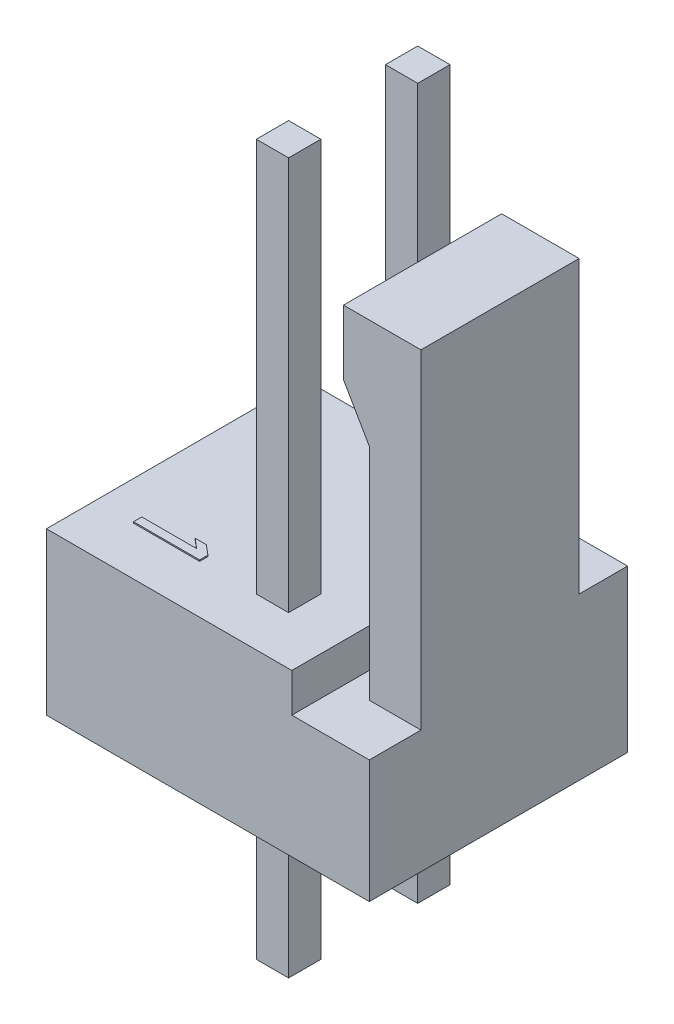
ISO-10303-21;
HEADER;
FILE_DESCRIPTION(('STEP AP214'),'2;1');
FILE_NAME('part.step','',(''),(''),'','','');
FILE_SCHEMA(('AUTOMOTIVE_DESIGN { 1 0 10303 214 1 1 1 1 }'));
ENDSEC;
DATA;
#1=APPLICATION_CONTEXT('core data for automotive mechanical design processes');
#2=APPLICATION_PROTOCOL_DEFINITION('international standard','automotive_design',2000,#1);
#3=PRODUCT_CONTEXT('',#1,'mechanical');
#4=PRODUCT('Part','Part','',(#3));
#5=PRODUCT_RELATED_PRODUCT_CATEGORY('part','',(#4));
#6=PRODUCT_DEFINITION_FORMATION('','',#4);
#7=PRODUCT_DEFINITION_CONTEXT('part definition',#1,'design');
#8=PRODUCT_DEFINITION('design','',#6,#7);
#9=PRODUCT_DEFINITION_SHAPE('','',#8);
#10=(LENGTH_UNIT() NAMED_UNIT(*) SI_UNIT(.MILLI.,.METRE.));
#11=(NAMED_UNIT(*) PLANE_ANGLE_UNIT() SI_UNIT($,.RADIAN.));
#12=(NAMED_UNIT(*) SI_UNIT($,.STERADIAN.) SOLID_ANGLE_UNIT());
#13=UNCERTAINTY_MEASURE_WITH_UNIT(LENGTH_MEASURE(1.E-05),#10,'distance_accuracy_value','');
#14=(GEOMETRIC_REPRESENTATION_CONTEXT(3) GLOBAL_UNCERTAINTY_ASSIGNED_CONTEXT((#13)) GLOBAL_UNIT_ASSIGNED_CONTEXT((#10,
#11,#12)) REPRESENTATION_CONTEXT('',''));
#15=CARTESIAN_POINT('',(0.,0.,0.));
#16=DIRECTION('',(0.,0.,1.));
#17=DIRECTION('',(1.,0.,0.));
#18=AXIS2_PLACEMENT_3D('',#15,#16,#17);
#19=CARTESIAN_POINT('',(5.34504242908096,8.24499214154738,-8.47344));
#20=DIRECTION('',(-0.866025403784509,-0.499999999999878,0.));
#21=DIRECTION('',(-0.499999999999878,0.866025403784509,0.));
#22=AXIS2_PLACEMENT_3D('',#19,#20,#21);
#23=PLANE('',#22);
#24=DIRECTION('',(0.,0.,1.));
#25=VECTOR('',#24,1.);
#26=CARTESIAN_POINT('',(4.826,9.144,-12.7));
#27=LINE('',#26,#25);
#28=CARTESIAN_POINT('',(4.826,9.14400000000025,-11.7475000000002));
#29=VERTEX_POINT('',#28);
#30=CARTESIAN_POINT('',(4.82599999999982,9.14400000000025,-8.636));
#31=VERTEX_POINT('',#30);
#32=EDGE_CURVE('E491',#29,#31,#27,.T.);
#33=ORIENTED_EDGE('',*,*,#32,.F.);
#34=DIRECTION('',(0.499999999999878,-0.866025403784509,0.));
#35=VECTOR('',#34,1.);
#36=CARTESIAN_POINT('',(5.34504242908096,8.24499214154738,-11.7475000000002));
#37=LINE('',#36,#35);
#38=CARTESIAN_POINT('',(5.33400000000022,8.26411818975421,-11.7475000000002));
#39=VERTEX_POINT('',#38);
#40=EDGE_CURVE('E291',#29,#39,#37,.T.);
#41=ORIENTED_EDGE('',*,*,#40,.T.);
#42=DIRECTION('',(0.,0.,-1.));
#43=VECTOR('',#42,1.);
#44=CARTESIAN_POINT('',(5.334,8.26411818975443,-12.7));
#45=LINE('',#44,#43);
#46=CARTESIAN_POINT('',(5.33400000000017,8.26411818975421,-8.636));
#47=VERTEX_POINT('',#46);
#48=EDGE_CURVE('E290',#47,#39,#45,.T.);
#49=ORIENTED_EDGE('',*,*,#48,.F.);
#50=DIRECTION('',(-0.499999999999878,0.866025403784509,0.));
#51=VECTOR('',#50,1.);
#52=CARTESIAN_POINT('',(5.08,8.70405909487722,-8.636));
#53=LINE('',#52,#51);
#54=EDGE_CURVE('E308',#47,#31,#53,.T.);
#55=ORIENTED_EDGE('',*,*,#54,.T.);
#56=EDGE_LOOP('',(#33,#41,#49,#55));
#57=FACE_BOUND('',#56,.T.);
#58=ADVANCED_FACE('F38',(#57),#23,.T.);
#59=CARTESIAN_POINT('',(5.334,3.8504576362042,-8.47344));
#60=DIRECTION('',(-1.,0.,0.));
#61=DIRECTION('',(0.,1.,0.));
#62=AXIS2_PLACEMENT_3D('',#59,#60,#61);
#63=PLANE('',#62);
#64=ORIENTED_EDGE('',*,*,#48,.T.);
#65=DIRECTION('',(0.,-1.,0.));
#66=VECTOR('',#65,1.);
#67=CARTESIAN_POINT('',(5.334,3.8504576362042,-11.7475000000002));
#68=LINE('',#67,#66);
#69=CARTESIAN_POINT('',(5.334,4.699,-11.7475000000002));
#70=VERTEX_POINT('',#69);
#71=EDGE_CURVE('E282',#39,#70,#68,.T.);
#72=ORIENTED_EDGE('',*,*,#71,.T.);
#73=DIRECTION('',(0.,0.,1.));
#74=VECTOR('',#73,1.);
#75=CARTESIAN_POINT('',(5.334,4.699,-8.47344));
#76=LINE('',#75,#74);
#77=CARTESIAN_POINT('',(5.334,4.699,-12.7));
#78=VERTEX_POINT('',#77);
#79=EDGE_CURVE('E270',#78,#70,#76,.T.);
#80=ORIENTED_EDGE('',*,*,#79,.F.);
#81=DIRECTION('',(0.,1.,0.));
#82=VECTOR('',#81,1.);
#83=CARTESIAN_POINT('',(5.334,3.8504576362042,-12.7));
#84=LINE('',#83,#82);
#85=CARTESIAN_POINT('',(5.334,3.937,-12.7));
#86=VERTEX_POINT('',#85);
#87=EDGE_CURVE('E306',#86,#78,#84,.T.);
#88=ORIENTED_EDGE('',*,*,#87,.F.);
#89=DIRECTION('',(0.,0.,-1.));
#90=VECTOR('',#89,1.);
#91=CARTESIAN_POINT('',(5.334,3.937,-12.7));
#92=LINE('',#91,#90);
#93=CARTESIAN_POINT('',(5.334,3.93699999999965,-8.636));
#94=VERTEX_POINT('',#93);
#95=EDGE_CURVE('E454',#94,#86,#92,.T.);
#96=ORIENTED_EDGE('',*,*,#95,.F.);
#97=DIRECTION('',(0.,-1.,0.));
#98=VECTOR('',#97,1.);
#99=CARTESIAN_POINT('',(5.334,7.1755,-8.636));
#100=LINE('',#99,#98);
#101=EDGE_CURVE('E410',#47,#94,#100,.T.);
#102=ORIENTED_EDGE('',*,*,#101,.F.);
#103=EDGE_LOOP('',(#64,#72,#80,#88,#96,#102));
#104=FACE_BOUND('',#103,.T.);
#105=ADVANCED_FACE('F287',(#104),#63,.T.);
#106=CARTESIAN_POINT('',(4.826,9.1186,-8.47344));
#107=DIRECTION('',(-1.,0.,0.));
#108=DIRECTION('',(0.,1.,0.));
#109=AXIS2_PLACEMENT_3D('',#106,#107,#108);
#110=PLANE('',#109);
#111=DIRECTION('',(0.,0.,1.));
#112=VECTOR('',#111,1.);
#113=CARTESIAN_POINT('',(4.826,10.414,-12.7));
#114=LINE('',#113,#112);
#115=CARTESIAN_POINT('',(4.826,10.414,-11.7475000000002));
#116=VERTEX_POINT('',#115);
#117=CARTESIAN_POINT('',(4.826,10.414,-8.636));
#118=VERTEX_POINT('',#117);
#119=EDGE_CURVE('E399',#116,#118,#114,.T.);
#120=ORIENTED_EDGE('',*,*,#119,.F.);
#121=DIRECTION('',(0.,-1.,0.));
#122=VECTOR('',#121,1.);
#123=CARTESIAN_POINT('',(4.826,9.1186,-11.7475000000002));
#124=LINE('',#123,#122);
#125=EDGE_CURVE('E295',#116,#29,#124,.T.);
#126=ORIENTED_EDGE('',*,*,#125,.T.);
#127=ORIENTED_EDGE('',*,*,#32,.T.);
#128=DIRECTION('',(0.,-1.,0.));
#129=VECTOR('',#128,1.);
#130=CARTESIAN_POINT('',(4.826,7.1755,-8.636));
#131=LINE('',#130,#129);
#132=EDGE_CURVE('E404',#118,#31,#131,.T.);
#133=ORIENTED_EDGE('',*,*,#132,.F.);
#134=EDGE_LOOP('',(#120,#126,#127,#133));
#135=FACE_BOUND('',#134,.T.);
#136=ADVANCED_FACE('F560',(#135),#110,.T.);
#137=CARTESIAN_POINT('',(4.79552,10.414,-8.47344));
#138=DIRECTION('',(0.,1.,0.));
#139=DIRECTION('',(1.,0.,0.));
#140=AXIS2_PLACEMENT_3D('',#137,#138,#139);
#141=PLANE('',#140);
#142=DIRECTION('',(0.,0.,1.));
#143=VECTOR('',#142,1.);
#144=CARTESIAN_POINT('',(6.35,10.414,-12.7));
#145=LINE('',#144,#143);
#146=CARTESIAN_POINT('',(6.35,10.414,-11.7475000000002));
#147=VERTEX_POINT('',#146);
#148=CARTESIAN_POINT('',(6.35,10.414,-8.636));
#149=VERTEX_POINT('',#148);
#150=EDGE_CURVE('E347',#147,#149,#145,.T.);
#151=ORIENTED_EDGE('',*,*,#150,.F.);
#152=DIRECTION('',(-1.,0.,0.));
#153=VECTOR('',#152,1.);
#154=CARTESIAN_POINT('',(4.79552,10.414,-11.7475000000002));
#155=LINE('',#154,#153);
#156=EDGE_CURVE('E564',#147,#116,#155,.T.);
#157=ORIENTED_EDGE('',*,*,#156,.T.);
#158=ORIENTED_EDGE('',*,*,#119,.T.);
#159=DIRECTION('',(1.,0.,0.));
#160=VECTOR('',#159,1.);
#161=CARTESIAN_POINT('',(5.588,10.414,-8.636));
#162=LINE('',#161,#160);
#163=EDGE_CURVE('E401',#118,#149,#162,.T.);
#164=ORIENTED_EDGE('',*,*,#163,.T.);
#165=EDGE_LOOP('',(#151,#157,#158,#164));
#166=FACE_BOUND('',#165,.T.);
#167=ADVANCED_FACE('F556',(#166),#141,.T.);
#168=CARTESIAN_POINT('',(6.35,10.5918,-7.4168));
#169=DIRECTION('',(1.,0.,0.));
#170=DIRECTION('',(0.,-1.,0.));
#171=AXIS2_PLACEMENT_3D('',#168,#169,#170);
#172=PLANE('',#171);
#173=DIRECTION('',(0.,0.,-1.));
#174=VECTOR('',#173,1.);
#175=CARTESIAN_POINT('',(6.35,4.699,-7.4168));
#176=LINE('',#175,#174);
#177=CARTESIAN_POINT('',(6.35,4.699,-11.7475000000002));
#178=VERTEX_POINT('',#177);
#179=CARTESIAN_POINT('',(6.35,4.699,-12.7));
#180=VERTEX_POINT('',#179);
#181=EDGE_CURVE('E53',#178,#180,#176,.T.);
#182=ORIENTED_EDGE('',*,*,#181,.F.);
#183=DIRECTION('',(0.,1.,0.));
#184=VECTOR('',#183,1.);
#185=CARTESIAN_POINT('',(6.35,10.5918,-11.7475000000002));
#186=LINE('',#185,#184);
#187=EDGE_CURVE('E278',#178,#147,#186,.T.);
#188=ORIENTED_EDGE('',*,*,#187,.T.);
#189=ORIENTED_EDGE('',*,*,#150,.T.);
#190=DIRECTION('',(0.,-1.,0.));
#191=VECTOR('',#190,1.);
#192=CARTESIAN_POINT('',(6.35,5.969,-8.636));
#193=LINE('',#192,#191);
#194=CARTESIAN_POINT('',(6.35,3.937,-8.636));
#195=VERTEX_POINT('',#194);
#196=EDGE_CURVE('E349',#149,#195,#193,.T.);
#197=ORIENTED_EDGE('',*,*,#196,.T.);
#198=DIRECTION('',(0.,0.,-1.));
#199=VECTOR('',#198,1.);
#200=CARTESIAN_POINT('',(6.35,3.937,-12.7));
#201=LINE('',#200,#199);
#202=CARTESIAN_POINT('',(6.35,3.937,-7.62));
#203=VERTEX_POINT('',#202);
#204=EDGE_CURVE('E450',#203,#195,#201,.T.);
#205=ORIENTED_EDGE('',*,*,#204,.F.);
#206=DIRECTION('',(0.,-1.,0.));
#207=VECTOR('',#206,1.);
#208=CARTESIAN_POINT('',(6.35,3.1115,-7.62));
#209=LINE('',#208,#207);
#210=CARTESIAN_POINT('',(6.35,1.524,-7.62));
#211=VERTEX_POINT('',#210);
#212=EDGE_CURVE('E318',#203,#211,#209,.T.);
#213=ORIENTED_EDGE('',*,*,#212,.T.);
#214=DIRECTION('',(0.,0.,1.));
#215=VECTOR('',#214,1.);
#216=CARTESIAN_POINT('',(6.35,1.524,-12.7));
#217=LINE('',#216,#215);
#218=CARTESIAN_POINT('',(6.35,1.524,-12.7));
#219=VERTEX_POINT('',#218);
#220=EDGE_CURVE('E345',#219,#211,#217,.T.);
#221=ORIENTED_EDGE('',*,*,#220,.F.);
#222=DIRECTION('',(0.,-1.,0.));
#223=VECTOR('',#222,1.);
#224=CARTESIAN_POINT('',(6.35,10.5918,-12.7));
#225=LINE('',#224,#223);
#226=EDGE_CURVE('E300',#180,#219,#225,.T.);
#227=ORIENTED_EDGE('',*,*,#226,.F.);
#228=EDGE_LOOP('',(#182,#188,#189,#197,#205,#213,#221,#227));
#229=FACE_BOUND('',#228,.T.);
#230=ADVANCED_FACE('F552',(#229),#172,.T.);
#231=CARTESIAN_POINT('',(3.175,12.7254,-11.0904151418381));
#232=DIRECTION('',(-1.,0.,0.));
#233=DIRECTION('',(0.,0.,-1.));
#234=AXIS2_PLACEMENT_3D('',#231,#232,#233);
#235=PLANE('',#234);
#236=DIRECTION('',(0.,0.,-1.));
#237=VECTOR('',#236,1.);
#238=CARTESIAN_POINT('',(3.17500000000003,-1.524,-11.43));
#239=LINE('',#238,#237);
#240=CARTESIAN_POINT('',(3.17499999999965,-1.524,-11.1124999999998));
#241=VERTEX_POINT('',#240);
#242=CARTESIAN_POINT('',(3.17499999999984,-1.524,-11.7475000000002));
#243=VERTEX_POINT('',#242);
#244=EDGE_CURVE('E482',#241,#243,#239,.T.);
#245=ORIENTED_EDGE('',*,*,#244,.F.);
#246=DIRECTION('',(0.,-1.,0.));
#247=VECTOR('',#246,1.);
#248=CARTESIAN_POINT('',(3.17499999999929,5.461,-11.1125));
#249=LINE('',#248,#247);
#250=CARTESIAN_POINT('',(3.17499999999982,1.524,-11.1124999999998));
#251=VERTEX_POINT('',#250);
#252=EDGE_CURVE('E487',#251,#241,#249,.T.);
#253=ORIENTED_EDGE('',*,*,#252,.F.);
#254=DIRECTION('',(0.,0.,-1.));
#255=VECTOR('',#254,1.);
#256=CARTESIAN_POINT('',(3.175,1.524,-11.43));
#257=LINE('',#256,#255);
#258=CARTESIAN_POINT('',(3.17499999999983,1.524,-11.7475000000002));
#259=VERTEX_POINT('',#258);
#260=EDGE_CURVE('E500',#251,#259,#257,.T.);
#261=ORIENTED_EDGE('',*,*,#260,.T.);
#262=DIRECTION('',(0.,1.,0.));
#263=VECTOR('',#262,1.);
#264=CARTESIAN_POINT('',(3.17499999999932,5.461,-11.7475));
#265=LINE('',#264,#263);
#266=EDGE_CURVE('E474',#243,#259,#265,.T.);
#267=ORIENTED_EDGE('',*,*,#266,.F.);
#268=EDGE_LOOP('',(#245,#253,#261,#267));
#269=FACE_BOUND('',#268,.T.);
#270=ADVANCED_FACE('F576',(#269),#235,.T.);
#271=CARTESIAN_POINT('',(3.175,12.7254,-8.55041514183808));
#272=DIRECTION('',(-1.,0.,0.));
#273=DIRECTION('',(0.,0.,-1.));
#274=AXIS2_PLACEMENT_3D('',#271,#272,#273);
#275=PLANE('',#274);
#276=DIRECTION('',(0.,0.,-1.));
#277=VECTOR('',#276,1.);
#278=CARTESIAN_POINT('',(3.17500000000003,-1.524,-8.89));
#279=LINE('',#278,#277);
#280=CARTESIAN_POINT('',(3.17499999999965,-1.524,-8.57249999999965));
#281=VERTEX_POINT('',#280);
#282=CARTESIAN_POINT('',(3.17499999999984,-1.524,-9.20750000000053));
#283=VERTEX_POINT('',#282);
#284=EDGE_CURVE('E465',#281,#283,#279,.T.);
#285=ORIENTED_EDGE('',*,*,#284,.F.);
#286=DIRECTION('',(0.,-1.,0.));
#287=VECTOR('',#286,1.);
#288=CARTESIAN_POINT('',(3.17499999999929,5.461,-8.5725));
#289=LINE('',#288,#287);
#290=CARTESIAN_POINT('',(3.17499999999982,1.524,-8.57249999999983));
#291=VERTEX_POINT('',#290);
#292=EDGE_CURVE('E470',#291,#281,#289,.T.);
#293=ORIENTED_EDGE('',*,*,#292,.F.);
#294=DIRECTION('',(0.,0.,-1.));
#295=VECTOR('',#294,1.);
#296=CARTESIAN_POINT('',(3.175,1.524,-8.89));
#297=LINE('',#296,#295);
#298=CARTESIAN_POINT('',(3.17499999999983,1.524,-9.20750000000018));
#299=VERTEX_POINT('',#298);
#300=EDGE_CURVE('E498',#291,#299,#297,.T.);
#301=ORIENTED_EDGE('',*,*,#300,.T.);
#302=DIRECTION('',(0.,1.,0.));
#303=VECTOR('',#302,1.);
#304=CARTESIAN_POINT('',(3.17499999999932,5.461,-9.2075));
#305=LINE('',#304,#303);
#306=EDGE_CURVE('E457',#283,#299,#305,.T.);
#307=ORIENTED_EDGE('',*,*,#306,.F.);
#308=EDGE_LOOP('',(#285,#293,#301,#307));
#309=FACE_BOUND('',#308,.T.);
#310=ADVANCED_FACE('F579',(#309),#275,.T.);
#311=CARTESIAN_POINT('',(3.81,12.7254,-11.7695848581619));
#312=DIRECTION('',(1.,0.,0.));
#313=DIRECTION('',(0.,0.,1.));
#314=AXIS2_PLACEMENT_3D('',#311,#312,#313);
#315=PLANE('',#314);
#316=DIRECTION('',(0.,0.,1.));
#317=VECTOR('',#316,1.);
#318=CARTESIAN_POINT('',(3.81000000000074,12.446,-11.43));
#319=LINE('',#318,#317);
#320=CARTESIAN_POINT('',(3.81000000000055,12.446,-11.7475000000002));
#321=VERTEX_POINT('',#320);
#322=CARTESIAN_POINT('',(3.81000000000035,12.446,-11.1124999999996));
#323=VERTEX_POINT('',#322);
#324=EDGE_CURVE('E443',#321,#323,#319,.T.);
#325=ORIENTED_EDGE('',*,*,#324,.T.);
#326=DIRECTION('',(0.,1.,0.));
#327=VECTOR('',#326,1.);
#328=CARTESIAN_POINT('',(3.81000000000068,5.461,-11.1125));
#329=LINE('',#328,#327);
#330=CARTESIAN_POINT('',(3.81000000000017,4.699,-11.1124999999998));
#331=VERTEX_POINT('',#330);
#332=EDGE_CURVE('E446',#331,#323,#329,.T.);
#333=ORIENTED_EDGE('',*,*,#332,.F.);
#334=DIRECTION('',(0.,0.,-1.));
#335=VECTOR('',#334,1.);
#336=CARTESIAN_POINT('',(3.81,4.699,-11.43));
#337=LINE('',#336,#335);
#338=CARTESIAN_POINT('',(3.81000000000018,4.699,-11.7475000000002));
#339=VERTEX_POINT('',#338);
#340=EDGE_CURVE('E496',#331,#339,#337,.T.);
#341=ORIENTED_EDGE('',*,*,#340,.T.);
#342=DIRECTION('',(0.,-1.,0.));
#343=VECTOR('',#342,1.);
#344=CARTESIAN_POINT('',(3.81000000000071,5.461,-11.7475));
#345=LINE('',#344,#343);
#346=EDGE_CURVE('E432',#321,#339,#345,.T.);
#347=ORIENTED_EDGE('',*,*,#346,.F.);
#348=EDGE_LOOP('',(#325,#333,#341,#347));
#349=FACE_BOUND('',#348,.T.);
#350=ADVANCED_FACE('F583',(#349),#315,.T.);
#351=CARTESIAN_POINT('',(3.81,12.7254,-9.22958485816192));
#352=DIRECTION('',(1.,0.,0.));
#353=DIRECTION('',(0.,0.,1.));
#354=AXIS2_PLACEMENT_3D('',#351,#352,#353);
#355=PLANE('',#354);
#356=DIRECTION('',(0.,0.,1.));
#357=VECTOR('',#356,1.);
#358=CARTESIAN_POINT('',(3.81000000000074,12.446,-8.89));
#359=LINE('',#358,#357);
#360=CARTESIAN_POINT('',(3.81000000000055,12.446,-9.20750000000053));
#361=VERTEX_POINT('',#360);
#362=CARTESIAN_POINT('',(3.81000000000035,12.446,-8.57249999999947));
#363=VERTEX_POINT('',#362);
#364=EDGE_CURVE('E425',#361,#363,#359,.T.);
#365=ORIENTED_EDGE('',*,*,#364,.T.);
#366=DIRECTION('',(0.,1.,0.));
#367=VECTOR('',#366,1.);
#368=CARTESIAN_POINT('',(3.81000000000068,5.461,-8.5725));
#369=LINE('',#368,#367);
#370=CARTESIAN_POINT('',(3.81000000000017,4.699,-8.57249999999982));
#371=VERTEX_POINT('',#370);
#372=EDGE_CURVE('E428',#371,#363,#369,.T.);
#373=ORIENTED_EDGE('',*,*,#372,.F.);
#374=DIRECTION('',(0.,0.,-1.));
#375=VECTOR('',#374,1.);
#376=CARTESIAN_POINT('',(3.81,4.699,-8.89));
#377=LINE('',#376,#375);
#378=CARTESIAN_POINT('',(3.81000000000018,4.699,-9.20750000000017));
#379=VERTEX_POINT('',#378);
#380=EDGE_CURVE('E494',#371,#379,#377,.T.);
#381=ORIENTED_EDGE('',*,*,#380,.T.);
#382=DIRECTION('',(0.,-1.,0.));
#383=VECTOR('',#382,1.);
#384=CARTESIAN_POINT('',(3.81000000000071,5.461,-9.2075));
#385=LINE('',#384,#383);
#386=EDGE_CURVE('E413',#361,#379,#385,.T.);
#387=ORIENTED_EDGE('',*,*,#386,.F.);
#388=EDGE_LOOP('',(#365,#373,#381,#387));
#389=FACE_BOUND('',#388,.T.);
#390=ADVANCED_FACE('F587',(#389),#355,.T.);
#391=CARTESIAN_POINT('',(3.83208485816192,12.7254,-11.1125));
#392=DIRECTION('',(0.,0.,1.));
#393=DIRECTION('',(-1.,0.,0.));
#394=AXIS2_PLACEMENT_3D('',#391,#392,#393);
#395=PLANE('',#394);
#396=DIRECTION('',(-1.,0.,0.));
#397=VECTOR('',#396,1.);
#398=CARTESIAN_POINT('',(3.4925,-1.524,-11.1125));
#399=LINE('',#398,#397);
#400=CARTESIAN_POINT('',(3.81000000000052,-1.524,-11.1124999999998));
#401=VERTEX_POINT('',#400);
#402=EDGE_CURVE('E484',#401,#241,#399,.T.);
#403=ORIENTED_EDGE('',*,*,#402,.F.);
#404=DIRECTION('',(0.,-1.,0.));
#405=VECTOR('',#404,1.);
#406=CARTESIAN_POINT('',(3.81,5.461,-11.1124999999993));
#407=LINE('',#406,#405);
#408=CARTESIAN_POINT('',(3.81000000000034,1.524,-11.1124999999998));
#409=VERTEX_POINT('',#408);
#410=EDGE_CURVE('E397',#409,#401,#407,.T.);
#411=ORIENTED_EDGE('',*,*,#410,.F.);
#412=DIRECTION('',(-1.,0.,0.));
#413=VECTOR('',#412,1.);
#414=CARTESIAN_POINT('',(3.4925,1.524,-11.1125));
#415=LINE('',#414,#413);
#416=EDGE_CURVE('E489',#409,#251,#415,.T.);
#417=ORIENTED_EDGE('',*,*,#416,.T.);
#418=ORIENTED_EDGE('',*,*,#252,.T.);
#419=EDGE_LOOP('',(#403,#411,#417,#418));
#420=FACE_BOUND('',#419,.T.);
#421=ADVANCED_FACE('F590',(#420),#395,.T.);
#422=CARTESIAN_POINT('',(3.83208485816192,-1.524,-11.7695848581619));
#423=DIRECTION('',(0.,-1.,0.));
#424=DIRECTION('',(0.,0.,1.));
#425=AXIS2_PLACEMENT_3D('',#422,#423,#424);
#426=PLANE('',#425);
#427=ORIENTED_EDGE('',*,*,#402,.T.);
#428=ORIENTED_EDGE('',*,*,#244,.T.);
#429=DIRECTION('',(-1.,0.,0.));
#430=VECTOR('',#429,1.);
#431=CARTESIAN_POINT('',(3.4925,-1.524,-11.7475));
#432=LINE('',#431,#430);
#433=CARTESIAN_POINT('',(3.81000000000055,-1.524,-11.7475000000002));
#434=VERTEX_POINT('',#433);
#435=EDGE_CURVE('E477',#434,#243,#432,.T.);
#436=ORIENTED_EDGE('',*,*,#435,.F.);
#437=DIRECTION('',(0.,0.,-1.));
#438=VECTOR('',#437,1.);
#439=CARTESIAN_POINT('',(3.81,-1.524,-11.43));
#440=LINE('',#439,#438);
#441=EDGE_CURVE('E395',#401,#434,#440,.T.);
#442=ORIENTED_EDGE('',*,*,#441,.F.);
#443=EDGE_LOOP('',(#427,#428,#436,#442));
#444=FACE_BOUND('',#443,.T.);
#445=ADVANCED_FACE('F597',(#444),#426,.T.);
#446=CARTESIAN_POINT('',(3.15291514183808,12.7254,-11.7475));
#447=DIRECTION('',(0.,0.,-1.));
#448=DIRECTION('',(1.,0.,0.));
#449=AXIS2_PLACEMENT_3D('',#446,#447,#448);
#450=PLANE('',#449);
#451=ORIENTED_EDGE('',*,*,#435,.T.);
#452=ORIENTED_EDGE('',*,*,#266,.T.);
#453=DIRECTION('',(1.,0.,0.));
#454=VECTOR('',#453,1.);
#455=CARTESIAN_POINT('',(3.4925,1.524,-11.7475));
#456=LINE('',#455,#454);
#457=CARTESIAN_POINT('',(3.81000000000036,1.524,-11.7475000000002));
#458=VERTEX_POINT('',#457);
#459=EDGE_CURVE('E480',#259,#458,#456,.T.);
#460=ORIENTED_EDGE('',*,*,#459,.T.);
#461=DIRECTION('',(0.,1.,0.));
#462=VECTOR('',#461,1.);
#463=CARTESIAN_POINT('',(3.81,5.461,-11.7475000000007));
#464=LINE('',#463,#462);
#465=EDGE_CURVE('E392',#434,#458,#464,.T.);
#466=ORIENTED_EDGE('',*,*,#465,.F.);
#467=EDGE_LOOP('',(#451,#452,#460,#466));
#468=FACE_BOUND('',#467,.T.);
#469=ADVANCED_FACE('F601',(#468),#450,.T.);
#470=CARTESIAN_POINT('',(3.83208485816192,12.7254,-8.5725));
#471=DIRECTION('',(0.,0.,1.));
#472=DIRECTION('',(-1.,0.,0.));
#473=AXIS2_PLACEMENT_3D('',#470,#471,#472);
#474=PLANE('',#473);
#475=DIRECTION('',(-1.,0.,0.));
#476=VECTOR('',#475,1.);
#477=CARTESIAN_POINT('',(3.4925,-1.524,-8.57249999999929));
#478=LINE('',#477,#476);
#479=CARTESIAN_POINT('',(3.81000000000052,-1.524,-8.57249999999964));
#480=VERTEX_POINT('',#479);
#481=EDGE_CURVE('E467',#480,#281,#478,.T.);
#482=ORIENTED_EDGE('',*,*,#481,.F.);
#483=DIRECTION('',(0.,-1.,0.));
#484=VECTOR('',#483,1.);
#485=CARTESIAN_POINT('',(3.81,5.461,-8.57249999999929));
#486=LINE('',#485,#484);
#487=CARTESIAN_POINT('',(3.81000000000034,1.524,-8.57249999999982));
#488=VERTEX_POINT('',#487);
#489=EDGE_CURVE('E390',#488,#480,#486,.T.);
#490=ORIENTED_EDGE('',*,*,#489,.F.);
#491=DIRECTION('',(-1.,0.,0.));
#492=VECTOR('',#491,1.);
#493=CARTESIAN_POINT('',(3.4925,1.524,-8.5725));
#494=LINE('',#493,#492);
#495=EDGE_CURVE('E472',#488,#291,#494,.T.);
#496=ORIENTED_EDGE('',*,*,#495,.T.);
#497=ORIENTED_EDGE('',*,*,#292,.T.);
#498=EDGE_LOOP('',(#482,#490,#496,#497));
#499=FACE_BOUND('',#498,.T.);
#500=ADVANCED_FACE('F605',(#499),#474,.T.);
#501=CARTESIAN_POINT('',(3.83208485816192,-1.524,-9.22958485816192));
#502=DIRECTION('',(0.,-1.,0.));
#503=DIRECTION('',(0.,0.,1.));
#504=AXIS2_PLACEMENT_3D('',#501,#502,#503);
#505=PLANE('',#504);
#506=ORIENTED_EDGE('',*,*,#481,.T.);
#507=ORIENTED_EDGE('',*,*,#284,.T.);
#508=DIRECTION('',(-1.,0.,0.));
#509=VECTOR('',#508,1.);
#510=CARTESIAN_POINT('',(3.4925,-1.524,-9.2075));
#511=LINE('',#510,#509);
#512=CARTESIAN_POINT('',(3.81000000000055,-1.524,-9.20750000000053));
#513=VERTEX_POINT('',#512);
#514=EDGE_CURVE('E460',#513,#283,#511,.T.);
#515=ORIENTED_EDGE('',*,*,#514,.F.);
#516=DIRECTION('',(0.,0.,-1.));
#517=VECTOR('',#516,1.);
#518=CARTESIAN_POINT('',(3.81,-1.524,-8.89));
#519=LINE('',#518,#517);
#520=EDGE_CURVE('E388',#480,#513,#519,.T.);
#521=ORIENTED_EDGE('',*,*,#520,.F.);
#522=EDGE_LOOP('',(#506,#507,#515,#521));
#523=FACE_BOUND('',#522,.T.);
#524=ADVANCED_FACE('F609',(#523),#505,.T.);
#525=CARTESIAN_POINT('',(3.15291514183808,12.7254,-9.2075));
#526=DIRECTION('',(0.,0.,-1.));
#527=DIRECTION('',(1.,0.,0.));
#528=AXIS2_PLACEMENT_3D('',#525,#526,#527);
#529=PLANE('',#528);
#530=ORIENTED_EDGE('',*,*,#514,.T.);
#531=ORIENTED_EDGE('',*,*,#306,.T.);
#532=DIRECTION('',(1.,0.,0.));
#533=VECTOR('',#532,1.);
#534=CARTESIAN_POINT('',(3.4925,1.524,-9.2075));
#535=LINE('',#534,#533);
#536=CARTESIAN_POINT('',(3.81000000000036,1.524,-9.20750000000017));
#537=VERTEX_POINT('',#536);
#538=EDGE_CURVE('E463',#299,#537,#535,.T.);
#539=ORIENTED_EDGE('',*,*,#538,.T.);
#540=DIRECTION('',(0.,1.,0.));
#541=VECTOR('',#540,1.);
#542=CARTESIAN_POINT('',(3.81,5.461,-9.20750000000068));
#543=LINE('',#542,#541);
#544=EDGE_CURVE('E385',#513,#537,#543,.T.);
#545=ORIENTED_EDGE('',*,*,#544,.F.);
#546=EDGE_LOOP('',(#530,#531,#539,#545));
#547=FACE_BOUND('',#546,.T.);
#548=ADVANCED_FACE('F613',(#547),#529,.T.);
#549=CARTESIAN_POINT('',(4.79552,3.937,-7.4168));
#550=DIRECTION('',(0.,1.,0.));
#551=DIRECTION('',(1.,0.,0.));
#552=AXIS2_PLACEMENT_3D('',#549,#550,#551);
#553=PLANE('',#552);
#554=DIRECTION('',(1.,0.,0.));
#555=VECTOR('',#554,1.);
#556=CARTESIAN_POINT('',(4.79552,3.937,-12.7));
#557=LINE('',#556,#555);
#558=CARTESIAN_POINT('',(4.826,3.93699999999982,-12.7));
#559=VERTEX_POINT('',#558);
#560=EDGE_CURVE('E304',#559,#86,#557,.T.);
#561=ORIENTED_EDGE('',*,*,#560,.F.);
#562=DIRECTION('',(0.,0.,-1.));
#563=VECTOR('',#562,1.);
#564=CARTESIAN_POINT('',(4.826,3.93699999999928,-12.7));
#565=LINE('',#564,#563);
#566=CARTESIAN_POINT('',(4.826,3.93699999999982,-7.62));
#567=VERTEX_POINT('',#566);
#568=EDGE_CURVE('E380',#567,#559,#565,.T.);
#569=ORIENTED_EDGE('',*,*,#568,.F.);
#570=DIRECTION('',(1.,0.,0.));
#571=VECTOR('',#570,1.);
#572=CARTESIAN_POINT('',(5.588,3.937,-7.62));
#573=LINE('',#572,#571);
#574=EDGE_CURVE('E452',#567,#203,#573,.T.);
#575=ORIENTED_EDGE('',*,*,#574,.T.);
#576=ORIENTED_EDGE('',*,*,#204,.T.);
#577=DIRECTION('',(1.,0.,0.));
#578=VECTOR('',#577,1.);
#579=CARTESIAN_POINT('',(5.588,3.937,-8.636));
#580=LINE('',#579,#578);
#581=EDGE_CURVE('E407',#94,#195,#580,.T.);
#582=ORIENTED_EDGE('',*,*,#581,.F.);
#583=ORIENTED_EDGE('',*,*,#95,.T.);
#584=EDGE_LOOP('',(#561,#569,#575,#576,#582,#583));
#585=FACE_BOUND('',#584,.T.);
#586=ADVANCED_FACE('F542',(#585),#553,.T.);
#587=CARTESIAN_POINT('',(3.83208485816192,12.7254,-11.1125));
#588=DIRECTION('',(0.,0.,1.));
#589=DIRECTION('',(-1.,0.,0.));
#590=AXIS2_PLACEMENT_3D('',#587,#588,#589);
#591=PLANE('',#590);
#592=DIRECTION('',(-1.,0.,0.));
#593=VECTOR('',#592,1.);
#594=CARTESIAN_POINT('',(3.4925,12.446,-11.1125));
#595=LINE('',#594,#593);
#596=CARTESIAN_POINT('',(3.17499999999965,12.446,-11.1124999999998));
#597=VERTEX_POINT('',#596);
#598=EDGE_CURVE('E440',#323,#597,#595,.T.);
#599=ORIENTED_EDGE('',*,*,#598,.T.);
#600=DIRECTION('',(0.,1.,0.));
#601=VECTOR('',#600,1.);
#602=CARTESIAN_POINT('',(3.175,5.461,-11.1124999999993));
#603=LINE('',#602,#601);
#604=CARTESIAN_POINT('',(3.17499999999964,4.699,-11.1124999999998));
#605=VERTEX_POINT('',#604);
#606=EDGE_CURVE('E378',#605,#597,#603,.T.);
#607=ORIENTED_EDGE('',*,*,#606,.F.);
#608=DIRECTION('',(1.,0.,0.));
#609=VECTOR('',#608,1.);
#610=CARTESIAN_POINT('',(3.4925,4.699,-11.1125));
#611=LINE('',#610,#609);
#612=EDGE_CURVE('E448',#605,#331,#611,.T.);
#613=ORIENTED_EDGE('',*,*,#612,.T.);
#614=ORIENTED_EDGE('',*,*,#332,.T.);
#615=EDGE_LOOP('',(#599,#607,#613,#614));
#616=FACE_BOUND('',#615,.T.);
#617=ADVANCED_FACE('F620',(#616),#591,.T.);
#618=CARTESIAN_POINT('',(3.83208485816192,12.446,-11.7695848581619));
#619=DIRECTION('',(0.,-1.,0.));
#620=DIRECTION('',(0.,0.,1.));
#621=AXIS2_PLACEMENT_3D('',#618,#619,#620);
#622=PLANE('',#621);
#623=ORIENTED_EDGE('',*,*,#598,.F.);
#624=ORIENTED_EDGE('',*,*,#324,.F.);
#625=DIRECTION('',(1.,0.,0.));
#626=VECTOR('',#625,1.);
#627=CARTESIAN_POINT('',(3.4925,12.446,-11.7475));
#628=LINE('',#627,#626);
#629=CARTESIAN_POINT('',(3.17499999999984,12.446,-11.7475000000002));
#630=VERTEX_POINT('',#629);
#631=EDGE_CURVE('E435',#630,#321,#628,.T.);
#632=ORIENTED_EDGE('',*,*,#631,.F.);
#633=DIRECTION('',(0.,0.,-1.));
#634=VECTOR('',#633,1.);
#635=CARTESIAN_POINT('',(3.175,12.446,-11.43));
#636=LINE('',#635,#634);
#637=EDGE_CURVE('E376',#597,#630,#636,.T.);
#638=ORIENTED_EDGE('',*,*,#637,.F.);
#639=EDGE_LOOP('',(#623,#624,#632,#638));
#640=FACE_BOUND('',#639,.T.);
#641=ADVANCED_FACE('F623',(#640),#622,.F.);
#642=CARTESIAN_POINT('',(3.15291514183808,12.7254,-11.7475));
#643=DIRECTION('',(0.,0.,-1.));
#644=DIRECTION('',(1.,0.,0.));
#645=AXIS2_PLACEMENT_3D('',#642,#643,#644);
#646=PLANE('',#645);
#647=ORIENTED_EDGE('',*,*,#631,.T.);
#648=ORIENTED_EDGE('',*,*,#346,.T.);
#649=DIRECTION('',(-1.,0.,0.));
#650=VECTOR('',#649,1.);
#651=CARTESIAN_POINT('',(3.4925,4.699,-11.7475));
#652=LINE('',#651,#650);
#653=CARTESIAN_POINT('',(3.17499999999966,4.699,-11.7475000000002));
#654=VERTEX_POINT('',#653);
#655=EDGE_CURVE('E438',#339,#654,#652,.T.);
#656=ORIENTED_EDGE('',*,*,#655,.T.);
#657=DIRECTION('',(0.,-1.,0.));
#658=VECTOR('',#657,1.);
#659=CARTESIAN_POINT('',(3.175,5.461,-11.7475000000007));
#660=LINE('',#659,#658);
#661=EDGE_CURVE('E373',#630,#654,#660,.T.);
#662=ORIENTED_EDGE('',*,*,#661,.F.);
#663=EDGE_LOOP('',(#647,#648,#656,#662));
#664=FACE_BOUND('',#663,.T.);
#665=ADVANCED_FACE('F627',(#664),#646,.T.);
#666=CARTESIAN_POINT('',(3.83208485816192,12.7254,-8.5725));
#667=DIRECTION('',(0.,0.,1.));
#668=DIRECTION('',(-1.,0.,0.));
#669=AXIS2_PLACEMENT_3D('',#666,#667,#668);
#670=PLANE('',#669);
#671=DIRECTION('',(-1.,0.,0.));
#672=VECTOR('',#671,1.);
#673=CARTESIAN_POINT('',(3.4925,12.446,-8.57249999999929));
#674=LINE('',#673,#672);
#675=CARTESIAN_POINT('',(3.17499999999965,12.446,-8.57249999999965));
#676=VERTEX_POINT('',#675);
#677=EDGE_CURVE('E422',#363,#676,#674,.T.);
#678=ORIENTED_EDGE('',*,*,#677,.T.);
#679=DIRECTION('',(0.,1.,0.));
#680=VECTOR('',#679,1.);
#681=CARTESIAN_POINT('',(3.175,5.461,-8.57249999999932));
#682=LINE('',#681,#680);
#683=CARTESIAN_POINT('',(3.17499999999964,4.699,-8.57249999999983));
#684=VERTEX_POINT('',#683);
#685=EDGE_CURVE('E371',#684,#676,#682,.T.);
#686=ORIENTED_EDGE('',*,*,#685,.F.);
#687=DIRECTION('',(1.,0.,0.));
#688=VECTOR('',#687,1.);
#689=CARTESIAN_POINT('',(3.4925,4.699,-8.5725));
#690=LINE('',#689,#688);
#691=EDGE_CURVE('E430',#684,#371,#690,.T.);
#692=ORIENTED_EDGE('',*,*,#691,.T.);
#693=ORIENTED_EDGE('',*,*,#372,.T.);
#694=EDGE_LOOP('',(#678,#686,#692,#693));
#695=FACE_BOUND('',#694,.T.);
#696=ADVANCED_FACE('F631',(#695),#670,.T.);
#697=CARTESIAN_POINT('',(3.83208485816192,12.446,-9.22958485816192));
#698=DIRECTION('',(0.,-1.,0.));
#699=DIRECTION('',(0.,0.,1.));
#700=AXIS2_PLACEMENT_3D('',#697,#698,#699);
#701=PLANE('',#700);
#702=ORIENTED_EDGE('',*,*,#677,.F.);
#703=ORIENTED_EDGE('',*,*,#364,.F.);
#704=DIRECTION('',(1.,0.,0.));
#705=VECTOR('',#704,1.);
#706=CARTESIAN_POINT('',(3.4925,12.446,-9.2075));
#707=LINE('',#706,#705);
#708=CARTESIAN_POINT('',(3.17499999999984,12.446,-9.20750000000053));
#709=VERTEX_POINT('',#708);
#710=EDGE_CURVE('E417',#709,#361,#707,.T.);
#711=ORIENTED_EDGE('',*,*,#710,.F.);
#712=DIRECTION('',(0.,0.,-1.));
#713=VECTOR('',#712,1.);
#714=CARTESIAN_POINT('',(3.175,12.446,-8.89));
#715=LINE('',#714,#713);
#716=EDGE_CURVE('E369',#676,#709,#715,.T.);
#717=ORIENTED_EDGE('',*,*,#716,.F.);
#718=EDGE_LOOP('',(#702,#703,#711,#717));
#719=FACE_BOUND('',#718,.T.);
#720=ADVANCED_FACE('F635',(#719),#701,.F.);
#721=CARTESIAN_POINT('',(3.15291514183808,12.7254,-9.2075));
#722=DIRECTION('',(0.,0.,-1.));
#723=DIRECTION('',(1.,0.,0.));
#724=AXIS2_PLACEMENT_3D('',#721,#722,#723);
#725=PLANE('',#724);
#726=ORIENTED_EDGE('',*,*,#710,.T.);
#727=ORIENTED_EDGE('',*,*,#386,.T.);
#728=DIRECTION('',(-1.,0.,0.));
#729=VECTOR('',#728,1.);
#730=CARTESIAN_POINT('',(3.4925,4.699,-9.2075));
#731=LINE('',#730,#729);
#732=CARTESIAN_POINT('',(3.17499999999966,4.699,-9.20750000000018));
#733=VERTEX_POINT('',#732);
#734=EDGE_CURVE('E420',#379,#733,#731,.T.);
#735=ORIENTED_EDGE('',*,*,#734,.T.);
#736=DIRECTION('',(0.,-1.,0.));
#737=VECTOR('',#736,1.);
#738=CARTESIAN_POINT('',(3.175,5.461,-9.20750000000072));
#739=LINE('',#738,#737);
#740=EDGE_CURVE('E366',#709,#733,#739,.T.);
#741=ORIENTED_EDGE('',*,*,#740,.F.);
#742=EDGE_LOOP('',(#726,#727,#735,#741));
#743=FACE_BOUND('',#742,.T.);
#744=ADVANCED_FACE('F639',(#743),#725,.T.);
#745=CARTESIAN_POINT('',(0.735993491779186,4.7244,-8.91863303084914));
#746=DIRECTION('',(0.,1.,0.));
#747=DIRECTION('',(0.,0.,1.));
#748=AXIS2_PLACEMENT_3D('',#745,#746,#747);
#749=PLANE('',#748);
#750=DIRECTION('',(1.,0.,0.));
#751=VECTOR('',#750,1.);
#752=CARTESIAN_POINT('',(1.3014967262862,4.7244,-8.73400749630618));
#753=LINE('',#752,#751);
#754=CARTESIAN_POINT('',(0.761999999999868,4.7244,-8.73400749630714));
#755=VERTEX_POINT('',#754);
#756=CARTESIAN_POINT('',(1.84099345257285,4.7244,-8.7340074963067));
#757=VERTEX_POINT('',#756);
#758=EDGE_CURVE('E358',#755,#757,#753,.T.);
#759=ORIENTED_EDGE('',*,*,#758,.F.);
#760=DIRECTION('',(0.,0.,-1.));
#761=VECTOR('',#760,1.);
#762=CARTESIAN_POINT('',(0.762,4.7244,-8.65273715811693));
#763=LINE('',#762,#761);
#764=CARTESIAN_POINT('',(0.761999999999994,4.7244,-8.57146681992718));
#765=VERTEX_POINT('',#764);
#766=EDGE_CURVE('E359',#765,#755,#763,.T.);
#767=ORIENTED_EDGE('',*,*,#766,.F.);
#768=DIRECTION('',(-1.,0.,0.));
#769=VECTOR('',#768,1.);
#770=CARTESIAN_POINT('',(1.4121627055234,4.7244,-8.57146681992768));
#771=LINE('',#770,#769);
#772=CARTESIAN_POINT('',(2.06232541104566,4.7244,-8.57146681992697));
#773=VERTEX_POINT('',#772);
#774=EDGE_CURVE('E364',#773,#765,#771,.T.);
#775=ORIENTED_EDGE('',*,*,#774,.F.);
#776=DIRECTION('',(0.,0.,-1.));
#777=VECTOR('',#776,1.);
#778=CARTESIAN_POINT('',(2.06232541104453,4.7244,-8.73400749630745));
#779=LINE('',#778,#777);
#780=CARTESIAN_POINT('',(2.06232541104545,4.7244,-8.73400749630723));
#781=VERTEX_POINT('',#780);
#782=EDGE_CURVE('E416',#773,#781,#779,.T.);
#783=ORIENTED_EDGE('',*,*,#782,.T.);
#784=DIRECTION('',(-0.765974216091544,0.,-0.642871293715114));
#785=VECTOR('',#784,1.);
#786=CARTESIAN_POINT('',(2.06232541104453,4.7244,-8.73400749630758));
#787=LINE('',#786,#785);
#788=CARTESIAN_POINT('',(1.86865994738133,4.7244,-8.89654817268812));
#789=VERTEX_POINT('',#788);
#790=EDGE_CURVE('E505',#781,#789,#787,.T.);
#791=ORIENTED_EDGE('',*,*,#790,.T.);
#792=DIRECTION('',(-1.,0.,0.));
#793=VECTOR('',#792,1.);
#794=CARTESIAN_POINT('',(1.4121627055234,4.7244,-8.89654817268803));
#795=LINE('',#794,#793);
#796=CARTESIAN_POINT('',(1.6473279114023,4.7244,-8.89654817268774));
#797=VERTEX_POINT('',#796);
#798=EDGE_CURVE('E512',#789,#797,#795,.T.);
#799=ORIENTED_EDGE('',*,*,#798,.T.);
#800=DIRECTION('',(0.765974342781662,0.,0.642871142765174));
#801=VECTOR('',#800,1.);
#802=CARTESIAN_POINT('',(1.64732791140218,4.7244,-8.89654817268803));
#803=LINE('',#802,#801);
#804=EDGE_CURVE('E412',#797,#757,#803,.T.);
#805=ORIENTED_EDGE('',*,*,#804,.T.);
#806=EDGE_LOOP('',(#759,#767,#775,#783,#791,#799,#805));
#807=FACE_BOUND('',#806,.T.);
#808=ADVANCED_FACE('F643',(#807),#749,.T.);
#809=CARTESIAN_POINT('',(4.79552,3.80746,-8.636));
#810=DIRECTION('',(0.,0.,1.));
#811=DIRECTION('',(1.,0.,0.));
#812=AXIS2_PLACEMENT_3D('',#809,#810,#811);
#813=PLANE('',#812);
#814=ORIENTED_EDGE('',*,*,#132,.T.);
#815=ORIENTED_EDGE('',*,*,#54,.F.);
#816=ORIENTED_EDGE('',*,*,#101,.T.);
#817=ORIENTED_EDGE('',*,*,#581,.T.);
#818=ORIENTED_EDGE('',*,*,#196,.F.);
#819=ORIENTED_EDGE('',*,*,#163,.F.);
#820=EDGE_LOOP('',(#814,#815,#816,#817,#818,#819));
#821=FACE_BOUND('',#820,.T.);
#822=ADVANCED_FACE('F549',(#821),#813,.T.);
#823=CARTESIAN_POINT('',(3.81,12.7254,-11.7695848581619));
#824=DIRECTION('',(1.,0.,0.));
#825=DIRECTION('',(0.,0.,1.));
#826=AXIS2_PLACEMENT_3D('',#823,#824,#825);
#827=PLANE('',#826);
#828=ORIENTED_EDGE('',*,*,#441,.T.);
#829=ORIENTED_EDGE('',*,*,#465,.T.);
#830=DIRECTION('',(0.,0.,-1.));
#831=VECTOR('',#830,1.);
#832=CARTESIAN_POINT('',(3.81,1.524,-12.7));
#833=LINE('',#832,#831);
#834=EDGE_CURVE('E342',#409,#458,#833,.T.);
#835=ORIENTED_EDGE('',*,*,#834,.F.);
#836=ORIENTED_EDGE('',*,*,#410,.T.);
#837=EDGE_LOOP('',(#828,#829,#835,#836));
#838=FACE_BOUND('',#837,.T.);
#839=ADVANCED_FACE('F650',(#838),#827,.T.);
#840=CARTESIAN_POINT('',(3.81,12.7254,-9.22958485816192));
#841=DIRECTION('',(1.,0.,0.));
#842=DIRECTION('',(0.,0.,1.));
#843=AXIS2_PLACEMENT_3D('',#840,#841,#842);
#844=PLANE('',#843);
#845=ORIENTED_EDGE('',*,*,#520,.T.);
#846=ORIENTED_EDGE('',*,*,#544,.T.);
#847=DIRECTION('',(0.,0.,-1.));
#848=VECTOR('',#847,1.);
#849=CARTESIAN_POINT('',(3.81,1.524,-12.7));
#850=LINE('',#849,#848);
#851=EDGE_CURVE('E339',#488,#537,#850,.T.);
#852=ORIENTED_EDGE('',*,*,#851,.F.);
#853=ORIENTED_EDGE('',*,*,#489,.T.);
#854=EDGE_LOOP('',(#845,#846,#852,#853));
#855=FACE_BOUND('',#854,.T.);
#856=ADVANCED_FACE('F655',(#855),#844,.T.);
#857=CARTESIAN_POINT('',(4.826,4.72108485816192,-7.4168));
#858=DIRECTION('',(1.,0.,0.));
#859=DIRECTION('',(0.,-1.,0.));
#860=AXIS2_PLACEMENT_3D('',#857,#858,#859);
#861=PLANE('',#860);
#862=DIRECTION('',(0.,-1.,0.));
#863=VECTOR('',#862,1.);
#864=CARTESIAN_POINT('',(4.826,4.72108485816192,-12.7));
#865=LINE('',#864,#863);
#866=CARTESIAN_POINT('',(4.826,4.699,-12.7));
#867=VERTEX_POINT('',#866);
#868=EDGE_CURVE('E302',#867,#559,#865,.T.);
#869=ORIENTED_EDGE('',*,*,#868,.F.);
#870=DIRECTION('',(0.,0.,-1.));
#871=VECTOR('',#870,1.);
#872=CARTESIAN_POINT('',(4.826,4.699,-12.7));
#873=LINE('',#872,#871);
#874=CARTESIAN_POINT('',(4.826,4.69900000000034,-7.62));
#875=VERTEX_POINT('',#874);
#876=EDGE_CURVE('E335',#875,#867,#873,.T.);
#877=ORIENTED_EDGE('',*,*,#876,.F.);
#878=DIRECTION('',(0.,-1.,0.));
#879=VECTOR('',#878,1.);
#880=CARTESIAN_POINT('',(4.826,4.318,-7.62));
#881=LINE('',#880,#879);
#882=EDGE_CURVE('E383',#875,#567,#881,.T.);
#883=ORIENTED_EDGE('',*,*,#882,.T.);
#884=ORIENTED_EDGE('',*,*,#568,.T.);
#885=EDGE_LOOP('',(#869,#877,#883,#884));
#886=FACE_BOUND('',#885,.T.);
#887=ADVANCED_FACE('F538',(#886),#861,.T.);
#888=CARTESIAN_POINT('',(3.175,12.7254,-11.0904151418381));
#889=DIRECTION('',(-1.,0.,0.));
#890=DIRECTION('',(0.,0.,-1.));
#891=AXIS2_PLACEMENT_3D('',#888,#889,#890);
#892=PLANE('',#891);
#893=ORIENTED_EDGE('',*,*,#637,.T.);
#894=ORIENTED_EDGE('',*,*,#661,.T.);
#895=DIRECTION('',(0.,0.,-1.));
#896=VECTOR('',#895,1.);
#897=CARTESIAN_POINT('',(3.175,4.699,-12.7));
#898=LINE('',#897,#896);
#899=EDGE_CURVE('E330',#605,#654,#898,.T.);
#900=ORIENTED_EDGE('',*,*,#899,.F.);
#901=ORIENTED_EDGE('',*,*,#606,.T.);
#902=EDGE_LOOP('',(#893,#894,#900,#901));
#903=FACE_BOUND('',#902,.T.);
#904=ADVANCED_FACE('F662',(#903),#892,.T.);
#905=CARTESIAN_POINT('',(3.175,12.7254,-8.55041514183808));
#906=DIRECTION('',(-1.,0.,0.));
#907=DIRECTION('',(0.,0.,-1.));
#908=AXIS2_PLACEMENT_3D('',#905,#906,#907);
#909=PLANE('',#908);
#910=ORIENTED_EDGE('',*,*,#716,.T.);
#911=ORIENTED_EDGE('',*,*,#740,.T.);
#912=DIRECTION('',(0.,0.,-1.));
#913=VECTOR('',#912,1.);
#914=CARTESIAN_POINT('',(3.175,4.699,-12.7));
#915=LINE('',#914,#913);
#916=EDGE_CURVE('E327',#684,#733,#915,.T.);
#917=ORIENTED_EDGE('',*,*,#916,.F.);
#918=ORIENTED_EDGE('',*,*,#685,.T.);
#919=EDGE_LOOP('',(#910,#911,#917,#918));
#920=FACE_BOUND('',#919,.T.);
#921=ADVANCED_FACE('F665',(#920),#909,.T.);
#922=CARTESIAN_POINT('',(0.735993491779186,4.698492,-8.57146681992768));
#923=DIRECTION('',(0.,0.,1.));
#924=DIRECTION('',(1.,0.,0.));
#925=AXIS2_PLACEMENT_3D('',#922,#923,#924);
#926=PLANE('',#925);
#927=ORIENTED_EDGE('',*,*,#774,.T.);
#928=DIRECTION('',(0.,1.,0.));
#929=VECTOR('',#928,1.);
#930=CARTESIAN_POINT('',(0.762,4.7117,-8.57146681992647));
#931=LINE('',#930,#929);
#932=CARTESIAN_POINT('',(0.762000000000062,4.699,-8.57146681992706));
#933=VERTEX_POINT('',#932);
#934=EDGE_CURVE('E361',#933,#765,#931,.T.);
#935=ORIENTED_EDGE('',*,*,#934,.F.);
#936=DIRECTION('',(-1.,0.,0.));
#937=VECTOR('',#936,1.);
#938=CARTESIAN_POINT('',(2.413,4.699,-8.57146681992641));
#939=LINE('',#938,#937);
#940=CARTESIAN_POINT('',(2.0623254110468,4.699,-8.57146681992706));
#941=VERTEX_POINT('',#940);
#942=EDGE_CURVE('E325',#941,#933,#939,.T.);
#943=ORIENTED_EDGE('',*,*,#942,.F.);
#944=DIRECTION('',(0.,-1.,0.));
#945=VECTOR('',#944,1.);
#946=CARTESIAN_POINT('',(2.0623254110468,4.7117,-8.57146681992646));
#947=LINE('',#946,#945);
#948=EDGE_CURVE('E352',#773,#941,#947,.T.);
#949=ORIENTED_EDGE('',*,*,#948,.F.);
#950=EDGE_LOOP('',(#927,#935,#943,#949));
#951=FACE_BOUND('',#950,.T.);
#952=ADVANCED_FACE('F669',(#951),#926,.T.);
#953=CARTESIAN_POINT('',(0.762,4.698492,-8.73725830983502));
#954=DIRECTION('',(-1.,0.,0.));
#955=DIRECTION('',(0.,0.,1.));
#956=AXIS2_PLACEMENT_3D('',#953,#954,#955);
#957=PLANE('',#956);
#958=ORIENTED_EDGE('',*,*,#766,.T.);
#959=DIRECTION('',(0.,1.,0.));
#960=VECTOR('',#959,1.);
#961=CARTESIAN_POINT('',(0.761999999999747,4.7117,-8.73400749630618));
#962=LINE('',#961,#960);
#963=CARTESIAN_POINT('',(0.761999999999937,4.699,-8.73400749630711));
#964=VERTEX_POINT('',#963);
#965=EDGE_CURVE('E355',#964,#755,#962,.T.);
#966=ORIENTED_EDGE('',*,*,#965,.F.);
#967=DIRECTION('',(0.,0.,-1.));
#968=VECTOR('',#967,1.);
#969=CARTESIAN_POINT('',(0.762,4.699,-12.7));
#970=LINE('',#969,#968);
#971=EDGE_CURVE('E322',#933,#964,#970,.T.);
#972=ORIENTED_EDGE('',*,*,#971,.F.);
#973=ORIENTED_EDGE('',*,*,#934,.T.);
#974=EDGE_LOOP('',(#958,#966,#972,#973));
#975=FACE_BOUND('',#974,.T.);
#976=ADVANCED_FACE('F673',(#975),#957,.T.);
#977=CARTESIAN_POINT('',(1.86257332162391,4.698492,-8.73400749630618));
#978=DIRECTION('',(0.,0.,-1.));
#979=DIRECTION('',(-1.,0.,0.));
#980=AXIS2_PLACEMENT_3D('',#977,#978,#979);
#981=PLANE('',#980);
#982=ORIENTED_EDGE('',*,*,#758,.T.);
#983=DIRECTION('',(0.,1.,0.));
#984=VECTOR('',#983,1.);
#985=CARTESIAN_POINT('',(1.84099345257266,4.7117,-8.73400749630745));
#986=LINE('',#985,#984);
#987=CARTESIAN_POINT('',(1.84099345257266,4.699,-8.73400749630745));
#988=VERTEX_POINT('',#987);
#989=EDGE_CURVE('E516',#988,#757,#986,.T.);
#990=ORIENTED_EDGE('',*,*,#989,.F.);
#991=DIRECTION('',(1.,0.,0.));
#992=VECTOR('',#991,1.);
#993=CARTESIAN_POINT('',(2.413,4.699,-8.73400749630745));
#994=LINE('',#993,#992);
#995=EDGE_CURVE('E324',#964,#988,#994,.T.);
#996=ORIENTED_EDGE('',*,*,#995,.F.);
#997=ORIENTED_EDGE('',*,*,#965,.T.);
#998=EDGE_LOOP('',(#982,#990,#996,#997));
#999=FACE_BOUND('',#998,.T.);
#1000=ADVANCED_FACE('F677',(#999),#981,.T.);
#1001=CARTESIAN_POINT('',(1.64345460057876,4.698492,-8.89979898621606));
#1002=DIRECTION('',(-0.642871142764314,0.,0.765974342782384));
#1003=DIRECTION('',(0.765974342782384,0.,0.642871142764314));
#1004=AXIS2_PLACEMENT_3D('',#1001,#1002,#1003);
#1005=PLANE('',#1004);
#1006=ORIENTED_EDGE('',*,*,#804,.F.);
#1007=DIRECTION('',(0.,1.,0.));
#1008=VECTOR('',#1007,1.);
#1009=CARTESIAN_POINT('',(1.64732791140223,4.7117,-8.89654817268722));
#1010=LINE('',#1009,#1008);
#1011=CARTESIAN_POINT('',(1.64732791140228,4.699,-8.89654817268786));
#1012=VERTEX_POINT('',#1011);
#1013=EDGE_CURVE('E511',#1012,#797,#1010,.T.);
#1014=ORIENTED_EDGE('',*,*,#1013,.F.);
#1015=DIRECTION('',(-0.76597434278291,0.,-0.642871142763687));
#1016=VECTOR('',#1015,1.);
#1017=CARTESIAN_POINT('',(1.84099345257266,4.699,-8.73400749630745));
#1018=LINE('',#1017,#1016);
#1019=EDGE_CURVE('E524',#988,#1012,#1018,.T.);
#1020=ORIENTED_EDGE('',*,*,#1019,.F.);
#1021=ORIENTED_EDGE('',*,*,#989,.T.);
#1022=EDGE_LOOP('',(#1006,#1014,#1020,#1021));
#1023=FACE_BOUND('',#1022,.T.);
#1024=ADVANCED_FACE('F681',(#1023),#1005,.T.);
#1025=CARTESIAN_POINT('',(1.87308658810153,4.698492,-8.89654817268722));
#1026=DIRECTION('',(0.,0.,-1.));
#1027=DIRECTION('',(-1.,0.,0.));
#1028=AXIS2_PLACEMENT_3D('',#1025,#1026,#1027);
#1029=PLANE('',#1028);
#1030=ORIENTED_EDGE('',*,*,#798,.F.);
#1031=DIRECTION('',(0.,1.,0.));
#1032=VECTOR('',#1031,1.);
#1033=CARTESIAN_POINT('',(1.86865994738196,4.7117,-8.89654817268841));
#1034=LINE('',#1033,#1032);
#1035=CARTESIAN_POINT('',(1.86865994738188,4.699,-8.89654817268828));
#1036=VERTEX_POINT('',#1035);
#1037=EDGE_CURVE('E508',#1036,#789,#1034,.T.);
#1038=ORIENTED_EDGE('',*,*,#1037,.F.);
#1039=DIRECTION('',(1.,0.,0.));
#1040=VECTOR('',#1039,1.);
#1041=CARTESIAN_POINT('',(2.413,4.699,-8.89654817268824));
#1042=LINE('',#1041,#1040);
#1043=EDGE_CURVE('E521',#1012,#1036,#1042,.T.);
#1044=ORIENTED_EDGE('',*,*,#1043,.F.);
#1045=ORIENTED_EDGE('',*,*,#1013,.T.);
#1046=EDGE_LOOP('',(#1030,#1038,#1044,#1045));
#1047=FACE_BOUND('',#1046,.T.);
#1048=ADVANCED_FACE('F685',(#1047),#1029,.T.);
#1049=CARTESIAN_POINT('',(2.06619872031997,4.698492,-8.73075668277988));
#1050=DIRECTION('',(0.642871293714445,0.,-0.765974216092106));
#1051=DIRECTION('',(-0.765974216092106,0.,-0.642871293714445));
#1052=AXIS2_PLACEMENT_3D('',#1049,#1050,#1051);
#1053=PLANE('',#1052);
#1054=ORIENTED_EDGE('',*,*,#790,.F.);
#1055=DIRECTION('',(0.,1.,0.));
#1056=VECTOR('',#1055,1.);
#1057=CARTESIAN_POINT('',(2.0623254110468,4.7117,-8.7340074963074));
#1058=LINE('',#1057,#1056);
#1059=CARTESIAN_POINT('',(2.0623254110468,4.699,-8.73400749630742));
#1060=VERTEX_POINT('',#1059);
#1061=EDGE_CURVE('E354',#1060,#781,#1058,.T.);
#1062=ORIENTED_EDGE('',*,*,#1061,.F.);
#1063=DIRECTION('',(0.765974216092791,0.,0.642871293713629));
#1064=VECTOR('',#1063,1.);
#1065=CARTESIAN_POINT('',(1.8686599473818,4.699,-8.89654817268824));
#1066=LINE('',#1065,#1064);
#1067=EDGE_CURVE('E523',#1036,#1060,#1066,.T.);
#1068=ORIENTED_EDGE('',*,*,#1067,.F.);
#1069=ORIENTED_EDGE('',*,*,#1037,.T.);
#1070=EDGE_LOOP('',(#1054,#1062,#1068,#1069));
#1071=FACE_BOUND('',#1070,.T.);
#1072=ADVANCED_FACE('F689',(#1071),#1053,.T.);
#1073=CARTESIAN_POINT('',(2.0623254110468,4.698492,-8.56821600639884));
#1074=DIRECTION('',(1.,0.,0.));
#1075=DIRECTION('',(0.,0.,-1.));
#1076=AXIS2_PLACEMENT_3D('',#1073,#1074,#1075);
#1077=PLANE('',#1076);
#1078=ORIENTED_EDGE('',*,*,#782,.F.);
#1079=ORIENTED_EDGE('',*,*,#948,.T.);
#1080=DIRECTION('',(0.,0.,1.));
#1081=VECTOR('',#1080,1.);
#1082=CARTESIAN_POINT('',(2.0623254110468,4.699,-12.7));
#1083=LINE('',#1082,#1081);
#1084=EDGE_CURVE('E321',#1060,#941,#1083,.T.);
#1085=ORIENTED_EDGE('',*,*,#1084,.F.);
#1086=ORIENTED_EDGE('',*,*,#1061,.T.);
#1087=EDGE_LOOP('',(#1078,#1079,#1085,#1086));
#1088=FACE_BOUND('',#1087,.T.);
#1089=ADVANCED_FACE('F693',(#1088),#1077,.T.);
#1090=CARTESIAN_POINT('',(6.477,1.524,-7.4168));
#1091=DIRECTION('',(0.,-1.,0.));
#1092=DIRECTION('',(-1.,0.,0.));
#1093=AXIS2_PLACEMENT_3D('',#1090,#1091,#1092);
#1094=PLANE('',#1093);
#1095=DIRECTION('',(-1.,0.,0.));
#1096=VECTOR('',#1095,1.);
#1097=CARTESIAN_POINT('',(6.477,1.524,-12.7));
#1098=LINE('',#1097,#1096);
#1099=CARTESIAN_POINT('',(0.,1.524,-12.7));
#1100=VERTEX_POINT('',#1099);
#1101=EDGE_CURVE('E293',#219,#1100,#1098,.T.);
#1102=ORIENTED_EDGE('',*,*,#1101,.F.);
#1103=ORIENTED_EDGE('',*,*,#220,.T.);
#1104=DIRECTION('',(-1.,0.,0.));
#1105=VECTOR('',#1104,1.);
#1106=CARTESIAN_POINT('',(3.175,1.524,-7.62));
#1107=LINE('',#1106,#1105);
#1108=CARTESIAN_POINT('',(0.,1.524,-7.62));
#1109=VERTEX_POINT('',#1108);
#1110=EDGE_CURVE('E315',#211,#1109,#1107,.T.);
#1111=ORIENTED_EDGE('',*,*,#1110,.T.);
#1112=DIRECTION('',(0.,0.,1.));
#1113=VECTOR('',#1112,1.);
#1114=CARTESIAN_POINT('',(0.,1.524,-12.7));
#1115=LINE('',#1114,#1113);
#1116=EDGE_CURVE('E337',#1100,#1109,#1115,.T.);
#1117=ORIENTED_EDGE('',*,*,#1116,.F.);
#1118=EDGE_LOOP('',(#1102,#1103,#1111,#1117));
#1119=FACE_BOUND('',#1118,.T.);
#1120=ORIENTED_EDGE('',*,*,#495,.F.);
#1121=ORIENTED_EDGE('',*,*,#851,.T.);
#1122=ORIENTED_EDGE('',*,*,#538,.F.);
#1123=ORIENTED_EDGE('',*,*,#300,.F.);
#1124=EDGE_LOOP('',(#1120,#1121,#1122,#1123));
#1125=FACE_BOUND('',#1124,.T.);
#1126=ORIENTED_EDGE('',*,*,#416,.F.);
#1127=ORIENTED_EDGE('',*,*,#834,.T.);
#1128=ORIENTED_EDGE('',*,*,#459,.F.);
#1129=ORIENTED_EDGE('',*,*,#260,.F.);
#1130=EDGE_LOOP('',(#1126,#1127,#1128,#1129));
#1131=FACE_BOUND('',#1130,.T.);
#1132=ADVANCED_FACE('F697',(#1119,#1125,#1131),#1094,.T.);
#1133=CARTESIAN_POINT('',(0.,1.4605,-7.4168));
#1134=DIRECTION('',(-1.,0.,0.));
#1135=DIRECTION('',(0.,1.,0.));
#1136=AXIS2_PLACEMENT_3D('',#1133,#1134,#1135);
#1137=PLANE('',#1136);
#1138=DIRECTION('',(0.,1.,0.));
#1139=VECTOR('',#1138,1.);
#1140=CARTESIAN_POINT('',(0.,1.4605,-12.7));
#1141=LINE('',#1140,#1139);
#1142=CARTESIAN_POINT('',(0.,4.699,-12.7));
#1143=VERTEX_POINT('',#1142);
#1144=EDGE_CURVE('E60',#1100,#1143,#1141,.T.);
#1145=ORIENTED_EDGE('',*,*,#1144,.F.);
#1146=ORIENTED_EDGE('',*,*,#1116,.T.);
#1147=DIRECTION('',(0.,1.,0.));
#1148=VECTOR('',#1147,1.);
#1149=CARTESIAN_POINT('',(0.,3.1115,-7.62));
#1150=LINE('',#1149,#1148);
#1151=CARTESIAN_POINT('',(0.,4.699,-7.62));
#1152=VERTEX_POINT('',#1151);
#1153=EDGE_CURVE('E312',#1109,#1152,#1150,.T.);
#1154=ORIENTED_EDGE('',*,*,#1153,.T.);
#1155=DIRECTION('',(0.,0.,1.));
#1156=VECTOR('',#1155,1.);
#1157=CARTESIAN_POINT('',(0.,4.699,-12.7));
#1158=LINE('',#1157,#1156);
#1159=EDGE_CURVE('E333',#1143,#1152,#1158,.T.);
#1160=ORIENTED_EDGE('',*,*,#1159,.F.);
#1161=EDGE_LOOP('',(#1145,#1146,#1154,#1160));
#1162=FACE_BOUND('',#1161,.T.);
#1163=ADVANCED_FACE('F703',(#1162),#1137,.T.);
#1164=CARTESIAN_POINT('',(-0.09652,4.699,-7.4168));
#1165=DIRECTION('',(0.,1.,0.));
#1166=DIRECTION('',(1.,0.,0.));
#1167=AXIS2_PLACEMENT_3D('',#1164,#1165,#1166);
#1168=PLANE('',#1167);
#1169=ORIENTED_EDGE('',*,*,#655,.F.);
#1170=ORIENTED_EDGE('',*,*,#340,.F.);
#1171=ORIENTED_EDGE('',*,*,#612,.F.);
#1172=ORIENTED_EDGE('',*,*,#899,.T.);
#1173=EDGE_LOOP('',(#1169,#1170,#1171,#1172));
#1174=FACE_BOUND('',#1173,.T.);
#1175=ORIENTED_EDGE('',*,*,#876,.T.);
#1176=DIRECTION('',(1.,0.,0.));
#1177=VECTOR('',#1176,1.);
#1178=CARTESIAN_POINT('',(-0.09652,4.699,-12.7));
#1179=LINE('',#1178,#1177);
#1180=EDGE_CURVE('E46',#1143,#867,#1179,.T.);
#1181=ORIENTED_EDGE('',*,*,#1180,.F.);
#1182=ORIENTED_EDGE('',*,*,#1159,.T.);
#1183=DIRECTION('',(1.,0.,0.));
#1184=VECTOR('',#1183,1.);
#1185=CARTESIAN_POINT('',(3.175,4.699,-7.62));
#1186=LINE('',#1185,#1184);
#1187=EDGE_CURVE('E309',#1152,#875,#1186,.T.);
#1188=ORIENTED_EDGE('',*,*,#1187,.T.);
#1189=EDGE_LOOP('',(#1175,#1181,#1182,#1188));
#1190=FACE_BOUND('',#1189,.T.);
#1191=ORIENTED_EDGE('',*,*,#691,.F.);
#1192=ORIENTED_EDGE('',*,*,#916,.T.);
#1193=ORIENTED_EDGE('',*,*,#734,.F.);
#1194=ORIENTED_EDGE('',*,*,#380,.F.);
#1195=EDGE_LOOP('',(#1191,#1192,#1193,#1194));
#1196=FACE_BOUND('',#1195,.T.);
#1197=ORIENTED_EDGE('',*,*,#1067,.T.);
#1198=ORIENTED_EDGE('',*,*,#1084,.T.);
#1199=ORIENTED_EDGE('',*,*,#942,.T.);
#1200=ORIENTED_EDGE('',*,*,#971,.T.);
#1201=ORIENTED_EDGE('',*,*,#995,.T.);
#1202=ORIENTED_EDGE('',*,*,#1019,.T.);
#1203=ORIENTED_EDGE('',*,*,#1043,.T.);
#1204=EDGE_LOOP('',(#1197,#1198,#1199,#1200,#1201,#1202,#1203));
#1205=FACE_BOUND('',#1204,.T.);
#1206=ADVANCED_FACE('F706',(#1174,#1190,#1196,#1205),#1168,.T.);
#1207=CARTESIAN_POINT('',(6.477,1.4605,-7.62));
#1208=DIRECTION('',(0.,0.,-1.));
#1209=DIRECTION('',(-1.,0.,0.));
#1210=AXIS2_PLACEMENT_3D('',#1207,#1208,#1209);
#1211=PLANE('',#1210);
#1212=ORIENTED_EDGE('',*,*,#1187,.F.);
#1213=ORIENTED_EDGE('',*,*,#1153,.F.);
#1214=ORIENTED_EDGE('',*,*,#1110,.F.);
#1215=ORIENTED_EDGE('',*,*,#212,.F.);
#1216=ORIENTED_EDGE('',*,*,#574,.F.);
#1217=ORIENTED_EDGE('',*,*,#882,.F.);
#1218=EDGE_LOOP('',(#1212,#1213,#1214,#1215,#1216,#1217));
#1219=FACE_BOUND('',#1218,.T.);
#1220=ADVANCED_FACE('F40',(#1219),#1211,.F.);
#1221=CARTESIAN_POINT('',(-1.56873542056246,-1.524,-12.7));
#1222=DIRECTION('',(0.,0.,1.));
#1223=DIRECTION('',(1.,0.,0.));
#1224=AXIS2_PLACEMENT_3D('',#1221,#1222,#1223);
#1225=PLANE('',#1224);
#1226=ORIENTED_EDGE('',*,*,#87,.T.);
#1227=DIRECTION('',(1.,0.,0.));
#1228=VECTOR('',#1227,1.);
#1229=CARTESIAN_POINT('',(-1.56873542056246,4.699,-12.7));
#1230=LINE('',#1229,#1228);
#1231=EDGE_CURVE('E11',#78,#180,#1230,.T.);
#1232=ORIENTED_EDGE('',*,*,#1231,.T.);
#1233=ORIENTED_EDGE('',*,*,#226,.T.);
#1234=ORIENTED_EDGE('',*,*,#1101,.T.);
#1235=ORIENTED_EDGE('',*,*,#1144,.T.);
#1236=ORIENTED_EDGE('',*,*,#1180,.T.);
#1237=ORIENTED_EDGE('',*,*,#868,.T.);
#1238=ORIENTED_EDGE('',*,*,#560,.T.);
#1239=EDGE_LOOP('',(#1226,#1232,#1233,#1234,#1235,#1236,#1237,#1238));
#1240=FACE_BOUND('',#1239,.T.);
#1241=ADVANCED_FACE('F532',(#1240),#1225,.F.);
#1242=CARTESIAN_POINT('',(-1.98342523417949,12.446,-11.7475000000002));
#1243=DIRECTION('',(0.,0.,-1.));
#1244=DIRECTION('',(-1.,0.,0.));
#1245=AXIS2_PLACEMENT_3D('',#1242,#1243,#1244);
#1246=PLANE('',#1245);
#1247=ORIENTED_EDGE('',*,*,#40,.F.);
#1248=ORIENTED_EDGE('',*,*,#125,.F.);
#1249=ORIENTED_EDGE('',*,*,#156,.F.);
#1250=ORIENTED_EDGE('',*,*,#187,.F.);
#1251=DIRECTION('',(1.,0.,0.));
#1252=VECTOR('',#1251,1.);
#1253=CARTESIAN_POINT('',(-1.98342523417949,4.699,-11.7475000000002));
#1254=LINE('',#1253,#1252);
#1255=EDGE_CURVE('E273',#70,#178,#1254,.T.);
#1256=ORIENTED_EDGE('',*,*,#1255,.F.);
#1257=ORIENTED_EDGE('',*,*,#71,.F.);
#1258=EDGE_LOOP('',(#1247,#1248,#1249,#1250,#1256,#1257));
#1259=FACE_BOUND('',#1258,.T.);
#1260=ADVANCED_FACE('F281',(#1259),#1246,.T.);
#1261=CARTESIAN_POINT('',(-1.98342523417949,4.699,-14.9566171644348));
#1262=DIRECTION('',(0.,-1.,0.));
#1263=DIRECTION('',(0.,0.,-1.));
#1264=AXIS2_PLACEMENT_3D('',#1261,#1262,#1263);
#1265=PLANE('',#1264);
#1266=ORIENTED_EDGE('',*,*,#79,.T.);
#1267=ORIENTED_EDGE('',*,*,#1255,.T.);
#1268=ORIENTED_EDGE('',*,*,#181,.T.);
#1269=ORIENTED_EDGE('',*,*,#1231,.F.);
#1270=EDGE_LOOP('',(#1266,#1267,#1268,#1269));
#1271=FACE_BOUND('',#1270,.T.);
#1272=ADVANCED_FACE('F272',(#1271),#1265,.F.);
#1273=CLOSED_SHELL('',(#58,#105,#136,#167,#230,#270,#310,#350,#390,#421,#445,#469,#500,#524,
#548,#586,#617,#641,#665,#696,#720,#744,#808,#822,#839,#856,#887,#904,#921,#952,#976,#1000,
#1024,#1048,#1072,#1089,#1132,#1163,#1206,#1220,#1241,#1260,#1272));
#1274=MANIFOLD_SOLID_BREP('B2',#1273);
#1275=ADVANCED_BREP_SHAPE_REPRESENTATION('',(#18,#1274),#14);
#1276=SHAPE_DEFINITION_REPRESENTATION(#9,#1275);
ENDSEC;
END-ISO-10303-21;
